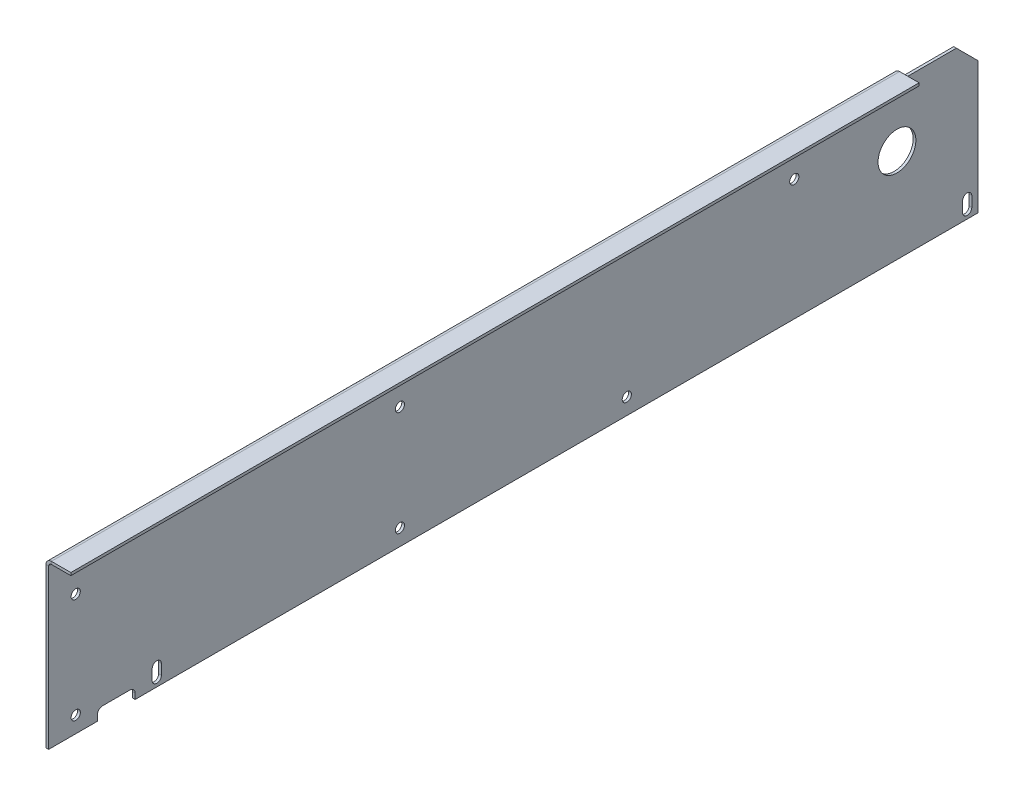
ISO-10303-21;
HEADER;
FILE_DESCRIPTION(('STEP AP214'),'2;1');
FILE_NAME('part.step','',(''),(''),'','','');
FILE_SCHEMA(('AUTOMOTIVE_DESIGN { 1 0 10303 214 1 1 1 1 }'));
ENDSEC;
DATA;
#1=APPLICATION_CONTEXT('core data for automotive mechanical design processes');
#2=APPLICATION_PROTOCOL_DEFINITION('international standard','automotive_design',2000,#1);
#3=PRODUCT_CONTEXT('',#1,'mechanical');
#4=PRODUCT('Part','Part','',(#3));
#5=PRODUCT_RELATED_PRODUCT_CATEGORY('part','',(#4));
#6=PRODUCT_DEFINITION_FORMATION('','',#4);
#7=PRODUCT_DEFINITION_CONTEXT('part definition',#1,'design');
#8=PRODUCT_DEFINITION('design','',#6,#7);
#9=PRODUCT_DEFINITION_SHAPE('','',#8);
#10=(LENGTH_UNIT() NAMED_UNIT(*) SI_UNIT(.MILLI.,.METRE.));
#11=(NAMED_UNIT(*) PLANE_ANGLE_UNIT() SI_UNIT($,.RADIAN.));
#12=(NAMED_UNIT(*) SI_UNIT($,.STERADIAN.) SOLID_ANGLE_UNIT());
#13=UNCERTAINTY_MEASURE_WITH_UNIT(LENGTH_MEASURE(1.E-05),#10,'distance_accuracy_value','');
#14=(GEOMETRIC_REPRESENTATION_CONTEXT(3) GLOBAL_UNCERTAINTY_ASSIGNED_CONTEXT((#13)) GLOBAL_UNIT_ASSIGNED_CONTEXT((#10,
#11,#12)) REPRESENTATION_CONTEXT('',''));
#15=CARTESIAN_POINT('',(0.,0.,0.));
#16=DIRECTION('',(0.,0.,1.));
#17=DIRECTION('',(1.,0.,0.));
#18=AXIS2_PLACEMENT_3D('',#15,#16,#17);
#19=CARTESIAN_POINT('',(2.5,0.,430.));
#20=DIRECTION('',(0.,-1.,0.));
#21=DIRECTION('',(0.,0.,-1.));
#22=AXIS2_PLACEMENT_3D('',#19,#20,#21);
#23=PLANE('',#22);
#24=DIRECTION('',(-1.,0.,0.));
#25=VECTOR('',#24,1.);
#26=CARTESIAN_POINT('',(23.001,0.,350.));
#27=LINE('',#26,#25);
#28=CARTESIAN_POINT('',(2.5,0.,350.));
#29=VERTEX_POINT('',#28);
#30=CARTESIAN_POINT('',(0.,0.,350.));
#31=VERTEX_POINT('',#30);
#32=EDGE_CURVE('E328',#29,#31,#27,.T.);
#33=ORIENTED_EDGE('',*,*,#32,.T.);
#34=DIRECTION('',(0.,0.,-1.));
#35=VECTOR('',#34,1.);
#36=CARTESIAN_POINT('',(0.,0.,430.));
#37=LINE('',#36,#35);
#38=CARTESIAN_POINT('',(0.,0.,-430.));
#39=VERTEX_POINT('',#38);
#40=EDGE_CURVE('E482',#31,#39,#37,.T.);
#41=ORIENTED_EDGE('',*,*,#40,.T.);
#42=DIRECTION('',(-1.,0.,0.));
#43=VECTOR('',#42,1.);
#44=CARTESIAN_POINT('',(2.5,0.,-430.));
#45=LINE('',#44,#43);
#46=CARTESIAN_POINT('',(2.5,0.,-430.));
#47=VERTEX_POINT('',#46);
#48=EDGE_CURVE('E431',#47,#39,#45,.T.);
#49=ORIENTED_EDGE('',*,*,#48,.F.);
#50=DIRECTION('',(0.,0.,-1.));
#51=VECTOR('',#50,1.);
#52=CARTESIAN_POINT('',(2.5,0.,430.));
#53=LINE('',#52,#51);
#54=EDGE_CURVE('E477',#29,#47,#53,.T.);
#55=ORIENTED_EDGE('',*,*,#54,.F.);
#56=EDGE_LOOP('',(#33,#41,#49,#55));
#57=FACE_BOUND('',#56,.T.);
#58=ADVANCED_FACE('F40',(#57),#23,.T.);
#59=CARTESIAN_POINT('',(5.,149.5,-430.));
#60=DIRECTION('',(0.,0.,-1.));
#61=DIRECTION('',(-1.,0.,0.));
#62=AXIS2_PLACEMENT_3D('',#59,#60,#61);
#63=PLANE('',#62);
#64=DIRECTION('',(0.,1.,0.));
#65=VECTOR('',#64,1.);
#66=CARTESIAN_POINT('',(0.,0.,-430.));
#67=LINE('',#66,#65);
#68=CARTESIAN_POINT('',(0.,122.,-430.));
#69=VERTEX_POINT('',#68);
#70=EDGE_CURVE('E428',#39,#69,#67,.T.);
#71=ORIENTED_EDGE('',*,*,#70,.T.);
#72=DIRECTION('',(1.,0.,0.));
#73=VECTOR('',#72,1.);
#74=CARTESIAN_POINT('',(5.,122.,-430.));
#75=LINE('',#74,#73);
#76=CARTESIAN_POINT('',(2.5,122.,-430.));
#77=VERTEX_POINT('',#76);
#78=EDGE_CURVE('E49',#69,#77,#75,.T.);
#79=ORIENTED_EDGE('',*,*,#78,.T.);
#80=DIRECTION('',(0.,1.,0.));
#81=VECTOR('',#80,1.);
#82=CARTESIAN_POINT('',(2.5,0.,-430.));
#83=LINE('',#82,#81);
#84=EDGE_CURVE('E435',#47,#77,#83,.T.);
#85=ORIENTED_EDGE('',*,*,#84,.F.);
#86=ORIENTED_EDGE('',*,*,#48,.T.);
#87=EDGE_LOOP('',(#71,#79,#85,#86));
#88=FACE_BOUND('',#87,.T.);
#89=ADVANCED_FACE('F569',(#88),#63,.T.);
#90=CARTESIAN_POINT('',(0.,149.5,430.));
#91=DIRECTION('',(0.,1.,0.));
#92=DIRECTION('',(-1.,0.,0.));
#93=AXIS2_PLACEMENT_3D('',#90,#91,#92);
#94=PLANE('',#93);
#95=DIRECTION('',(1.,0.,0.));
#96=VECTOR('',#95,1.);
#97=CARTESIAN_POINT('',(0.,149.5,-355.));
#98=LINE('',#97,#96);
#99=CARTESIAN_POINT('',(5.,149.5,-355.));
#100=VERTEX_POINT('',#99);
#101=CARTESIAN_POINT('',(23.,149.5,-355.));
#102=VERTEX_POINT('',#101);
#103=EDGE_CURVE('E392',#100,#102,#98,.T.);
#104=ORIENTED_EDGE('',*,*,#103,.T.);
#105=DIRECTION('',(0.,0.,-1.));
#106=VECTOR('',#105,1.);
#107=CARTESIAN_POINT('',(23.,149.5,430.));
#108=LINE('',#107,#106);
#109=CARTESIAN_POINT('',(23.,149.5,430.));
#110=VERTEX_POINT('',#109);
#111=EDGE_CURVE('E499',#110,#102,#108,.T.);
#112=ORIENTED_EDGE('',*,*,#111,.F.);
#113=DIRECTION('',(1.,0.,0.));
#114=VECTOR('',#113,1.);
#115=CARTESIAN_POINT('',(0.,149.5,430.));
#116=LINE('',#115,#114);
#117=CARTESIAN_POINT('',(5.,149.5,430.));
#118=VERTEX_POINT('',#117);
#119=EDGE_CURVE('E438',#118,#110,#116,.T.);
#120=ORIENTED_EDGE('',*,*,#119,.F.);
#121=DIRECTION('',(0.,0.,-1.));
#122=VECTOR('',#121,1.);
#123=CARTESIAN_POINT('',(5.,149.5,430.));
#124=LINE('',#123,#122);
#125=EDGE_CURVE('E469',#118,#100,#124,.T.);
#126=ORIENTED_EDGE('',*,*,#125,.T.);
#127=EDGE_LOOP('',(#104,#112,#120,#126));
#128=FACE_BOUND('',#127,.T.);
#129=ADVANCED_FACE('F576',(#128),#94,.F.);
#130=CARTESIAN_POINT('',(23.,152.,430.));
#131=DIRECTION('',(1.,0.,0.));
#132=DIRECTION('',(0.,1.,0.));
#133=AXIS2_PLACEMENT_3D('',#130,#131,#132);
#134=PLANE('',#133);
#135=ORIENTED_EDGE('',*,*,#111,.T.);
#136=DIRECTION('',(0.,-1.,0.));
#137=VECTOR('',#136,1.);
#138=CARTESIAN_POINT('',(23.,149.5,-355.));
#139=LINE('',#138,#137);
#140=CARTESIAN_POINT('',(23.,152.,-355.));
#141=VERTEX_POINT('',#140);
#142=EDGE_CURVE('E400',#102,#141,#139,.F.);
#143=ORIENTED_EDGE('',*,*,#142,.T.);
#144=DIRECTION('',(0.,0.,-1.));
#145=VECTOR('',#144,1.);
#146=CARTESIAN_POINT('',(23.,152.,430.));
#147=LINE('',#146,#145);
#148=CARTESIAN_POINT('',(23.,152.,430.));
#149=VERTEX_POINT('',#148);
#150=EDGE_CURVE('E495',#149,#141,#147,.T.);
#151=ORIENTED_EDGE('',*,*,#150,.F.);
#152=DIRECTION('',(0.,-1.,0.));
#153=VECTOR('',#152,1.);
#154=CARTESIAN_POINT('',(23.,152.,430.));
#155=LINE('',#154,#153);
#156=EDGE_CURVE('E441',#149,#110,#155,.T.);
#157=ORIENTED_EDGE('',*,*,#156,.T.);
#158=EDGE_LOOP('',(#135,#143,#151,#157));
#159=FACE_BOUND('',#158,.T.);
#160=ADVANCED_FACE('F652',(#159),#134,.T.);
#161=CARTESIAN_POINT('',(0.,152.,430.));
#162=DIRECTION('',(0.,1.,0.));
#163=DIRECTION('',(-1.,0.,0.));
#164=AXIS2_PLACEMENT_3D('',#161,#162,#163);
#165=PLANE('',#164);
#166=ORIENTED_EDGE('',*,*,#150,.T.);
#167=DIRECTION('',(-1.,0.,0.));
#168=VECTOR('',#167,1.);
#169=CARTESIAN_POINT('',(0.,152.,-355.));
#170=LINE('',#169,#168);
#171=CARTESIAN_POINT('',(5.,152.,-355.));
#172=VERTEX_POINT('',#171);
#173=EDGE_CURVE('E396',#172,#141,#170,.F.);
#174=ORIENTED_EDGE('',*,*,#173,.F.);
#175=DIRECTION('',(0.,0.,-1.));
#176=VECTOR('',#175,1.);
#177=CARTESIAN_POINT('',(5.00000000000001,152.,430.));
#178=LINE('',#177,#176);
#179=CARTESIAN_POINT('',(5.00000000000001,152.,430.));
#180=VERTEX_POINT('',#179);
#181=EDGE_CURVE('E491',#180,#172,#178,.T.);
#182=ORIENTED_EDGE('',*,*,#181,.F.);
#183=DIRECTION('',(1.,0.,0.));
#184=VECTOR('',#183,1.);
#185=CARTESIAN_POINT('',(0.,152.,430.));
#186=LINE('',#185,#184);
#187=EDGE_CURVE('E445',#180,#149,#186,.T.);
#188=ORIENTED_EDGE('',*,*,#187,.T.);
#189=EDGE_LOOP('',(#166,#174,#182,#188));
#190=FACE_BOUND('',#189,.T.);
#191=ADVANCED_FACE('F647',(#190),#165,.T.);
#192=CARTESIAN_POINT('',(5.,147.,430.));
#193=DIRECTION('',(0.,0.,-1.));
#194=DIRECTION('',(-1.,0.,0.));
#195=AXIS2_PLACEMENT_3D('',#192,#193,#194);
#196=CYLINDRICAL_SURFACE('',#195,5.);
#197=ORIENTED_EDGE('',*,*,#181,.T.);
#198=CARTESIAN_POINT('',(5.,147.,-355.));
#199=DIRECTION('',(0.,0.,1.));
#200=DIRECTION('',(1.,0.,0.));
#201=AXIS2_PLACEMENT_3D('',#198,#199,#200);
#202=CIRCLE('',#201,5.);
#203=CARTESIAN_POINT('',(0.,147.,-355.));
#204=VERTEX_POINT('',#203);
#205=EDGE_CURVE('E385',#204,#172,#202,.F.);
#206=ORIENTED_EDGE('',*,*,#205,.F.);
#207=DIRECTION('',(0.,0.,-1.));
#208=VECTOR('',#207,1.);
#209=CARTESIAN_POINT('',(0.,147.,430.));
#210=LINE('',#209,#208);
#211=CARTESIAN_POINT('',(0.,147.,430.));
#212=VERTEX_POINT('',#211);
#213=EDGE_CURVE('E487',#212,#204,#210,.T.);
#214=ORIENTED_EDGE('',*,*,#213,.F.);
#215=CARTESIAN_POINT('',(5.,147.,430.));
#216=DIRECTION('',(0.,0.,1.));
#217=DIRECTION('',(1.,0.,0.));
#218=AXIS2_PLACEMENT_3D('',#215,#216,#217);
#219=CIRCLE('',#218,5.);
#220=EDGE_CURVE('E449',#212,#180,#219,.F.);
#221=ORIENTED_EDGE('',*,*,#220,.T.);
#222=EDGE_LOOP('',(#197,#206,#214,#221));
#223=FACE_BOUND('',#222,.T.);
#224=ADVANCED_FACE('F641',(#223),#196,.T.);
#225=CARTESIAN_POINT('',(0.,0.,430.));
#226=DIRECTION('',(-1.,0.,0.));
#227=DIRECTION('',(0.,0.,1.));
#228=AXIS2_PLACEMENT_3D('',#225,#226,#227);
#229=PLANE('',#228);
#230=CARTESIAN_POINT('',(0.,16.75,330.));
#231=DIRECTION('',(-1.,0.,0.));
#232=DIRECTION('',(0.,0.,-1.));
#233=AXIS2_PLACEMENT_3D('',#230,#231,#232);
#234=CIRCLE('',#233,4.24999999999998);
#235=CARTESIAN_POINT('',(0.,16.75,334.25));
#236=VERTEX_POINT('',#235);
#237=CARTESIAN_POINT('',(0.,16.75,325.75));
#238=VERTEX_POINT('',#237);
#239=EDGE_CURVE('E229',#236,#238,#234,.T.);
#240=ORIENTED_EDGE('',*,*,#239,.F.);
#241=DIRECTION('',(0.,1.,0.));
#242=VECTOR('',#241,1.);
#243=CARTESIAN_POINT('',(0.,16.75,334.25));
#244=LINE('',#243,#242);
#245=CARTESIAN_POINT('',(0.,7.25000000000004,334.25));
#246=VERTEX_POINT('',#245);
#247=EDGE_CURVE('E245',#246,#236,#244,.T.);
#248=ORIENTED_EDGE('',*,*,#247,.F.);
#249=CARTESIAN_POINT('',(0.,7.25000000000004,330.));
#250=DIRECTION('',(-1.,0.,0.));
#251=DIRECTION('',(0.,0.,1.));
#252=AXIS2_PLACEMENT_3D('',#249,#250,#251);
#253=CIRCLE('',#252,4.24999999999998);
#254=CARTESIAN_POINT('',(0.,7.25000000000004,325.75));
#255=VERTEX_POINT('',#254);
#256=EDGE_CURVE('E542',#255,#246,#253,.T.);
#257=ORIENTED_EDGE('',*,*,#256,.F.);
#258=DIRECTION('',(0.,-1.,0.));
#259=VECTOR('',#258,1.);
#260=CARTESIAN_POINT('',(0.,16.75,325.75));
#261=LINE('',#260,#259);
#262=EDGE_CURVE('E220',#238,#255,#261,.T.);
#263=ORIENTED_EDGE('',*,*,#262,.F.);
#264=EDGE_LOOP('',(#240,#248,#257,#263));
#265=FACE_BOUND('',#264,.T.);
#266=CARTESIAN_POINT('',(0.,16.75,-420.));
#267=DIRECTION('',(-1.,0.,0.));
#268=DIRECTION('',(0.,0.,-1.));
#269=AXIS2_PLACEMENT_3D('',#266,#267,#268);
#270=CIRCLE('',#269,4.24999999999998);
#271=CARTESIAN_POINT('',(0.,16.75,-415.75));
#272=VERTEX_POINT('',#271);
#273=CARTESIAN_POINT('',(0.,16.75,-424.25));
#274=VERTEX_POINT('',#273);
#275=EDGE_CURVE('E259',#272,#274,#270,.T.);
#276=ORIENTED_EDGE('',*,*,#275,.F.);
#277=DIRECTION('',(0.,1.,0.));
#278=VECTOR('',#277,1.);
#279=CARTESIAN_POINT('',(0.,16.75,-415.75));
#280=LINE('',#279,#278);
#281=CARTESIAN_POINT('',(0.,7.25000000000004,-415.75));
#282=VERTEX_POINT('',#281);
#283=EDGE_CURVE('E270',#282,#272,#280,.T.);
#284=ORIENTED_EDGE('',*,*,#283,.F.);
#285=CARTESIAN_POINT('',(0.,7.25000000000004,-420.));
#286=DIRECTION('',(-1.,0.,0.));
#287=DIRECTION('',(0.,0.,1.));
#288=AXIS2_PLACEMENT_3D('',#285,#286,#287);
#289=CIRCLE('',#288,4.24999999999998);
#290=CARTESIAN_POINT('',(0.,7.25000000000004,-424.25));
#291=VERTEX_POINT('',#290);
#292=EDGE_CURVE('E266',#291,#282,#289,.T.);
#293=ORIENTED_EDGE('',*,*,#292,.F.);
#294=DIRECTION('',(0.,-1.,0.));
#295=VECTOR('',#294,1.);
#296=CARTESIAN_POINT('',(0.,16.75,-424.25));
#297=LINE('',#296,#295);
#298=EDGE_CURVE('E262',#274,#291,#297,.T.);
#299=ORIENTED_EDGE('',*,*,#298,.F.);
#300=EDGE_LOOP('',(#276,#284,#293,#299));
#301=FACE_BOUND('',#300,.T.);
#302=DIRECTION('',(0.,0.,1.));
#303=VECTOR('',#302,1.);
#304=CARTESIAN_POINT('',(0.,142.,430.));
#305=LINE('',#304,#303);
#306=CARTESIAN_POINT('',(0.,142.,-410.));
#307=VERTEX_POINT('',#306);
#308=CARTESIAN_POINT('',(0.,142.,-355.));
#309=VERTEX_POINT('',#308);
#310=EDGE_CURVE('E414',#307,#309,#305,.T.);
#311=ORIENTED_EDGE('',*,*,#310,.F.);
#312=DIRECTION('',(0.,-0.707106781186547,-0.707106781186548));
#313=VECTOR('',#312,1.);
#314=CARTESIAN_POINT('',(0.,491.,-60.9999999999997));
#315=LINE('',#314,#313);
#316=EDGE_CURVE('E63',#307,#69,#315,.T.);
#317=ORIENTED_EDGE('',*,*,#316,.T.);
#318=ORIENTED_EDGE('',*,*,#70,.F.);
#319=ORIENTED_EDGE('',*,*,#40,.F.);
#320=DIRECTION('',(0.,-1.,0.));
#321=VECTOR('',#320,1.);
#322=CARTESIAN_POINT('',(0.,0.,350.));
#323=LINE('',#322,#321);
#324=CARTESIAN_POINT('',(0.,5.,350.));
#325=VERTEX_POINT('',#324);
#326=EDGE_CURVE('E310',#325,#31,#323,.T.);
#327=ORIENTED_EDGE('',*,*,#326,.F.);
#328=CARTESIAN_POINT('',(0.,5.,355.));
#329=DIRECTION('',(-1.,0.,0.));
#330=DIRECTION('',(0.,0.,1.));
#331=AXIS2_PLACEMENT_3D('',#328,#329,#330);
#332=CIRCLE('',#331,5.);
#333=CARTESIAN_POINT('',(0.,10.,355.));
#334=VERTEX_POINT('',#333);
#335=EDGE_CURVE('E324',#334,#325,#332,.T.);
#336=ORIENTED_EDGE('',*,*,#335,.F.);
#337=DIRECTION('',(0.,0.,-1.));
#338=VECTOR('',#337,1.);
#339=CARTESIAN_POINT('',(0.,10.,355.));
#340=LINE('',#339,#338);
#341=CARTESIAN_POINT('',(0.,10.,380.));
#342=VERTEX_POINT('',#341);
#343=EDGE_CURVE('E320',#342,#334,#340,.T.);
#344=ORIENTED_EDGE('',*,*,#343,.F.);
#345=CARTESIAN_POINT('',(0.,5.,380.));
#346=DIRECTION('',(-1.,0.,0.));
#347=DIRECTION('',(0.,0.,1.));
#348=AXIS2_PLACEMENT_3D('',#345,#346,#347);
#349=CIRCLE('',#348,5.);
#350=CARTESIAN_POINT('',(0.,5.,385.));
#351=VERTEX_POINT('',#350);
#352=EDGE_CURVE('E316',#351,#342,#349,.T.);
#353=ORIENTED_EDGE('',*,*,#352,.F.);
#354=DIRECTION('',(0.,1.,0.));
#355=VECTOR('',#354,1.);
#356=CARTESIAN_POINT('',(0.,0.,385.));
#357=LINE('',#356,#355);
#358=CARTESIAN_POINT('',(0.,0.,385.));
#359=VERTEX_POINT('',#358);
#360=EDGE_CURVE('E313',#359,#351,#357,.T.);
#361=ORIENTED_EDGE('',*,*,#360,.F.);
#362=CARTESIAN_POINT('',(0.,0.,430.));
#363=VERTEX_POINT('',#362);
#364=EDGE_CURVE('E483',#363,#359,#37,.T.);
#365=ORIENTED_EDGE('',*,*,#364,.F.);
#366=DIRECTION('',(0.,1.,0.));
#367=VECTOR('',#366,1.);
#368=CARTESIAN_POINT('',(0.,0.,430.));
#369=LINE('',#368,#367);
#370=EDGE_CURVE('E453',#363,#212,#369,.T.);
#371=ORIENTED_EDGE('',*,*,#370,.T.);
#372=ORIENTED_EDGE('',*,*,#213,.T.);
#373=DIRECTION('',(0.,1.,0.));
#374=VECTOR('',#373,1.);
#375=CARTESIAN_POINT('',(0.,0.,-355.));
#376=LINE('',#375,#374);
#377=EDGE_CURVE('E417',#309,#204,#376,.T.);
#378=ORIENTED_EDGE('',*,*,#377,.F.);
#379=EDGE_LOOP('',(#311,#317,#318,#319,#327,#336,#344,#353,#361,#365,#371,#372,#378));
#380=FACE_BOUND('',#379,.T.);
#381=CARTESIAN_POINT('',(0.,14.9999999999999,405.));
#382=DIRECTION('',(-1.,0.,0.));
#383=DIRECTION('',(0.,0.,1.));
#384=AXIS2_PLACEMENT_3D('',#381,#382,#383);
#385=CIRCLE('',#384,4.24999999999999);
#386=CARTESIAN_POINT('',(0.,14.9999999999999,409.25));
#387=VERTEX_POINT('',#386);
#388=EDGE_CURVE('E332',#387,#387,#385,.T.);
#389=ORIENTED_EDGE('',*,*,#388,.F.);
#390=EDGE_LOOP('',(#389));
#391=FACE_BOUND('',#390,.T.);
#392=CARTESIAN_POINT('',(0.,112.,405.));
#393=DIRECTION('',(-1.,0.,0.));
#394=DIRECTION('',(0.,0.,1.));
#395=AXIS2_PLACEMENT_3D('',#392,#393,#394);
#396=CIRCLE('',#395,4.24999999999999);
#397=CARTESIAN_POINT('',(0.,112.,409.25));
#398=VERTEX_POINT('',#397);
#399=EDGE_CURVE('E352',#398,#398,#396,.T.);
#400=ORIENTED_EDGE('',*,*,#399,.F.);
#401=EDGE_LOOP('',(#400));
#402=FACE_BOUND('',#401,.T.);
#403=CARTESIAN_POINT('',(0.,112.,105.));
#404=DIRECTION('',(-1.,0.,0.));
#405=DIRECTION('',(0.,0.,1.));
#406=AXIS2_PLACEMENT_3D('',#403,#404,#405);
#407=CIRCLE('',#406,4.24999999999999);
#408=CARTESIAN_POINT('',(0.,112.,109.25));
#409=VERTEX_POINT('',#408);
#410=EDGE_CURVE('E357',#409,#409,#407,.T.);
#411=ORIENTED_EDGE('',*,*,#410,.F.);
#412=EDGE_LOOP('',(#411));
#413=FACE_BOUND('',#412,.T.);
#414=CARTESIAN_POINT('',(0.,14.9999999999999,105.));
#415=DIRECTION('',(-1.,0.,0.));
#416=DIRECTION('',(0.,0.,1.));
#417=AXIS2_PLACEMENT_3D('',#414,#415,#416);
#418=CIRCLE('',#417,4.24999999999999);
#419=CARTESIAN_POINT('',(0.,14.9999999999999,109.25));
#420=VERTEX_POINT('',#419);
#421=EDGE_CURVE('E362',#420,#420,#418,.T.);
#422=ORIENTED_EDGE('',*,*,#421,.F.);
#423=EDGE_LOOP('',(#422));
#424=FACE_BOUND('',#423,.T.);
#425=CARTESIAN_POINT('',(0.,14.9999999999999,-105.));
#426=DIRECTION('',(-1.,0.,0.));
#427=DIRECTION('',(0.,0.,1.));
#428=AXIS2_PLACEMENT_3D('',#425,#426,#427);
#429=CIRCLE('',#428,4.24999999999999);
#430=CARTESIAN_POINT('',(0.,14.9999999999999,-100.75));
#431=VERTEX_POINT('',#430);
#432=EDGE_CURVE('E367',#431,#431,#429,.T.);
#433=ORIENTED_EDGE('',*,*,#432,.F.);
#434=EDGE_LOOP('',(#433));
#435=FACE_BOUND('',#434,.T.);
#436=CARTESIAN_POINT('',(0.,112.,-260.));
#437=DIRECTION('',(-1.,0.,0.));
#438=DIRECTION('',(0.,0.,1.));
#439=AXIS2_PLACEMENT_3D('',#436,#437,#438);
#440=CIRCLE('',#439,4.24999999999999);
#441=CARTESIAN_POINT('',(0.,112.,-255.75));
#442=VERTEX_POINT('',#441);
#443=EDGE_CURVE('E372',#442,#442,#440,.T.);
#444=ORIENTED_EDGE('',*,*,#443,.F.);
#445=EDGE_LOOP('',(#444));
#446=FACE_BOUND('',#445,.T.);
#447=CARTESIAN_POINT('',(0.,87.,-355.));
#448=DIRECTION('',(-1.,0.,0.));
#449=DIRECTION('',(0.,0.,1.));
#450=AXIS2_PLACEMENT_3D('',#447,#448,#449);
#451=CIRCLE('',#450,17.4999999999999);
#452=CARTESIAN_POINT('',(0.,87.,-337.5));
#453=VERTEX_POINT('',#452);
#454=EDGE_CURVE('E377',#453,#453,#451,.T.);
#455=ORIENTED_EDGE('',*,*,#454,.F.);
#456=EDGE_LOOP('',(#455));
#457=FACE_BOUND('',#456,.T.);
#458=ADVANCED_FACE('F554',(#265,#301,#380,#391,#402,#413,#424,#435,#446,#457),#229,.T.);
#459=CARTESIAN_POINT('',(2.5,0.,430.));
#460=DIRECTION('',(-1.,0.,0.));
#461=DIRECTION('',(0.,0.,1.));
#462=AXIS2_PLACEMENT_3D('',#459,#460,#461);
#463=PLANE('',#462);
#464=DIRECTION('',(0.,-1.,0.));
#465=VECTOR('',#464,1.);
#466=CARTESIAN_POINT('',(2.5,16.75,334.25));
#467=LINE('',#466,#465);
#468=CARTESIAN_POINT('',(2.50000000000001,16.75,334.25));
#469=VERTEX_POINT('',#468);
#470=CARTESIAN_POINT('',(2.50000000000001,7.25000000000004,334.25));
#471=VERTEX_POINT('',#470);
#472=EDGE_CURVE('E235',#469,#471,#467,.T.);
#473=ORIENTED_EDGE('',*,*,#472,.F.);
#474=CARTESIAN_POINT('',(2.5,16.75,330.));
#475=DIRECTION('',(-1.,0.,0.));
#476=DIRECTION('',(0.,0.,1.));
#477=AXIS2_PLACEMENT_3D('',#474,#475,#476);
#478=CIRCLE('',#477,4.24999999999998);
#479=CARTESIAN_POINT('',(2.5,16.75,325.75));
#480=VERTEX_POINT('',#479);
#481=EDGE_CURVE('E226',#480,#469,#478,.F.);
#482=ORIENTED_EDGE('',*,*,#481,.F.);
#483=DIRECTION('',(0.,1.,0.));
#484=VECTOR('',#483,1.);
#485=CARTESIAN_POINT('',(2.5,16.75,325.75));
#486=LINE('',#485,#484);
#487=CARTESIAN_POINT('',(2.5,7.25000000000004,325.75));
#488=VERTEX_POINT('',#487);
#489=EDGE_CURVE('E209',#488,#480,#486,.T.);
#490=ORIENTED_EDGE('',*,*,#489,.F.);
#491=CARTESIAN_POINT('',(2.5,7.25000000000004,330.));
#492=DIRECTION('',(-1.,0.,0.));
#493=DIRECTION('',(0.,0.,1.));
#494=AXIS2_PLACEMENT_3D('',#491,#492,#493);
#495=CIRCLE('',#494,4.24999999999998);
#496=EDGE_CURVE('E534',#471,#488,#495,.F.);
#497=ORIENTED_EDGE('',*,*,#496,.F.);
#498=EDGE_LOOP('',(#473,#482,#490,#497));
#499=FACE_BOUND('',#498,.T.);
#500=DIRECTION('',(0.,-1.,0.));
#501=VECTOR('',#500,1.);
#502=CARTESIAN_POINT('',(2.5,16.75,-415.75));
#503=LINE('',#502,#501);
#504=CARTESIAN_POINT('',(2.50000000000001,16.75,-415.75));
#505=VERTEX_POINT('',#504);
#506=CARTESIAN_POINT('',(2.50000000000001,7.25000000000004,-415.75));
#507=VERTEX_POINT('',#506);
#508=EDGE_CURVE('E251',#505,#507,#503,.T.);
#509=ORIENTED_EDGE('',*,*,#508,.F.);
#510=CARTESIAN_POINT('',(2.5,16.75,-420.));
#511=DIRECTION('',(-1.,0.,0.));
#512=DIRECTION('',(0.,0.,1.));
#513=AXIS2_PLACEMENT_3D('',#510,#511,#512);
#514=CIRCLE('',#513,4.24999999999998);
#515=CARTESIAN_POINT('',(2.5,16.75,-424.25));
#516=VERTEX_POINT('',#515);
#517=EDGE_CURVE('E255',#516,#505,#514,.F.);
#518=ORIENTED_EDGE('',*,*,#517,.F.);
#519=DIRECTION('',(0.,1.,0.));
#520=VECTOR('',#519,1.);
#521=CARTESIAN_POINT('',(2.5,16.75,-424.25));
#522=LINE('',#521,#520);
#523=CARTESIAN_POINT('',(2.5,7.25000000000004,-424.25));
#524=VERTEX_POINT('',#523);
#525=EDGE_CURVE('E278',#524,#516,#522,.T.);
#526=ORIENTED_EDGE('',*,*,#525,.F.);
#527=CARTESIAN_POINT('',(2.5,7.25000000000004,-420.));
#528=DIRECTION('',(-1.,0.,0.));
#529=DIRECTION('',(0.,0.,1.));
#530=AXIS2_PLACEMENT_3D('',#527,#528,#529);
#531=CIRCLE('',#530,4.24999999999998);
#532=EDGE_CURVE('E242',#507,#524,#531,.F.);
#533=ORIENTED_EDGE('',*,*,#532,.F.);
#534=EDGE_LOOP('',(#509,#518,#526,#533));
#535=FACE_BOUND('',#534,.T.);
#536=CARTESIAN_POINT('',(2.5,14.9999999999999,405.));
#537=DIRECTION('',(-1.,0.,0.));
#538=DIRECTION('',(0.,0.,1.));
#539=AXIS2_PLACEMENT_3D('',#536,#537,#538);
#540=CIRCLE('',#539,4.24999999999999);
#541=CARTESIAN_POINT('',(2.5,14.9999999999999,409.25));
#542=VERTEX_POINT('',#541);
#543=EDGE_CURVE('E351',#542,#542,#540,.T.);
#544=ORIENTED_EDGE('',*,*,#543,.T.);
#545=EDGE_LOOP('',(#544));
#546=FACE_BOUND('',#545,.T.);
#547=CARTESIAN_POINT('',(2.5,112.,405.));
#548=DIRECTION('',(-1.,0.,0.));
#549=DIRECTION('',(0.,0.,1.));
#550=AXIS2_PLACEMENT_3D('',#547,#548,#549);
#551=CIRCLE('',#550,4.24999999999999);
#552=CARTESIAN_POINT('',(2.5,112.,409.25));
#553=VERTEX_POINT('',#552);
#554=EDGE_CURVE('E356',#553,#553,#551,.T.);
#555=ORIENTED_EDGE('',*,*,#554,.T.);
#556=EDGE_LOOP('',(#555));
#557=FACE_BOUND('',#556,.T.);
#558=CARTESIAN_POINT('',(2.5,112.,105.));
#559=DIRECTION('',(-1.,0.,0.));
#560=DIRECTION('',(0.,0.,1.));
#561=AXIS2_PLACEMENT_3D('',#558,#559,#560);
#562=CIRCLE('',#561,4.24999999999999);
#563=CARTESIAN_POINT('',(2.5,112.,109.25));
#564=VERTEX_POINT('',#563);
#565=EDGE_CURVE('E361',#564,#564,#562,.T.);
#566=ORIENTED_EDGE('',*,*,#565,.T.);
#567=EDGE_LOOP('',(#566));
#568=FACE_BOUND('',#567,.T.);
#569=CARTESIAN_POINT('',(2.5,14.9999999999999,105.));
#570=DIRECTION('',(-1.,0.,0.));
#571=DIRECTION('',(0.,0.,1.));
#572=AXIS2_PLACEMENT_3D('',#569,#570,#571);
#573=CIRCLE('',#572,4.24999999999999);
#574=CARTESIAN_POINT('',(2.5,14.9999999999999,109.25));
#575=VERTEX_POINT('',#574);
#576=EDGE_CURVE('E366',#575,#575,#573,.T.);
#577=ORIENTED_EDGE('',*,*,#576,.T.);
#578=EDGE_LOOP('',(#577));
#579=FACE_BOUND('',#578,.T.);
#580=CARTESIAN_POINT('',(2.5,14.9999999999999,-105.));
#581=DIRECTION('',(-1.,0.,0.));
#582=DIRECTION('',(0.,0.,1.));
#583=AXIS2_PLACEMENT_3D('',#580,#581,#582);
#584=CIRCLE('',#583,4.24999999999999);
#585=CARTESIAN_POINT('',(2.5,14.9999999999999,-100.75));
#586=VERTEX_POINT('',#585);
#587=EDGE_CURVE('E371',#586,#586,#584,.T.);
#588=ORIENTED_EDGE('',*,*,#587,.T.);
#589=EDGE_LOOP('',(#588));
#590=FACE_BOUND('',#589,.T.);
#591=CARTESIAN_POINT('',(2.5,112.,-260.));
#592=DIRECTION('',(-1.,0.,0.));
#593=DIRECTION('',(0.,0.,1.));
#594=AXIS2_PLACEMENT_3D('',#591,#592,#593);
#595=CIRCLE('',#594,4.24999999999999);
#596=CARTESIAN_POINT('',(2.5,112.,-255.75));
#597=VERTEX_POINT('',#596);
#598=EDGE_CURVE('E376',#597,#597,#595,.T.);
#599=ORIENTED_EDGE('',*,*,#598,.T.);
#600=EDGE_LOOP('',(#599));
#601=FACE_BOUND('',#600,.T.);
#602=CARTESIAN_POINT('',(2.5,87.,-355.));
#603=DIRECTION('',(-1.,0.,0.));
#604=DIRECTION('',(0.,0.,1.));
#605=AXIS2_PLACEMENT_3D('',#602,#603,#604);
#606=CIRCLE('',#605,17.4999999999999);
#607=CARTESIAN_POINT('',(2.5,87.,-337.5));
#608=VERTEX_POINT('',#607);
#609=EDGE_CURVE('E381',#608,#608,#606,.F.);
#610=ORIENTED_EDGE('',*,*,#609,.F.);
#611=EDGE_LOOP('',(#610));
#612=FACE_BOUND('',#611,.T.);
#613=ORIENTED_EDGE('',*,*,#84,.T.);
#614=DIRECTION('',(0.,0.707106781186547,0.707106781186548));
#615=VECTOR('',#614,1.);
#616=CARTESIAN_POINT('',(2.5,142.,-410.));
#617=LINE('',#616,#615);
#618=CARTESIAN_POINT('',(2.5,142.,-410.));
#619=VERTEX_POINT('',#618);
#620=EDGE_CURVE('E11',#77,#619,#617,.T.);
#621=ORIENTED_EDGE('',*,*,#620,.T.);
#622=DIRECTION('',(0.,0.,1.));
#623=VECTOR('',#622,1.);
#624=CARTESIAN_POINT('',(2.5,142.,430.));
#625=LINE('',#624,#623);
#626=CARTESIAN_POINT('',(2.5,142.,-355.));
#627=VERTEX_POINT('',#626);
#628=EDGE_CURVE('E404',#619,#627,#625,.T.);
#629=ORIENTED_EDGE('',*,*,#628,.T.);
#630=DIRECTION('',(0.,1.,0.));
#631=VECTOR('',#630,1.);
#632=CARTESIAN_POINT('',(2.5,0.,-355.));
#633=LINE('',#632,#631);
#634=CARTESIAN_POINT('',(2.5,147.,-355.));
#635=VERTEX_POINT('',#634);
#636=EDGE_CURVE('E410',#627,#635,#633,.T.);
#637=ORIENTED_EDGE('',*,*,#636,.T.);
#638=DIRECTION('',(0.,0.,-1.));
#639=VECTOR('',#638,1.);
#640=CARTESIAN_POINT('',(2.5,147.,430.));
#641=LINE('',#640,#639);
#642=CARTESIAN_POINT('',(2.5,147.,430.));
#643=VERTEX_POINT('',#642);
#644=EDGE_CURVE('E473',#643,#635,#641,.T.);
#645=ORIENTED_EDGE('',*,*,#644,.F.);
#646=DIRECTION('',(0.,1.,0.));
#647=VECTOR('',#646,1.);
#648=CARTESIAN_POINT('',(2.5,0.,430.));
#649=LINE('',#648,#647);
#650=CARTESIAN_POINT('',(2.5,0.,430.));
#651=VERTEX_POINT('',#650);
#652=EDGE_CURVE('E461',#651,#643,#649,.T.);
#653=ORIENTED_EDGE('',*,*,#652,.F.);
#654=CARTESIAN_POINT('',(2.5,0.,385.));
#655=VERTEX_POINT('',#654);
#656=EDGE_CURVE('E478',#651,#655,#53,.T.);
#657=ORIENTED_EDGE('',*,*,#656,.T.);
#658=DIRECTION('',(0.,-1.,0.));
#659=VECTOR('',#658,1.);
#660=CARTESIAN_POINT('',(2.5,0.,385.));
#661=LINE('',#660,#659);
#662=CARTESIAN_POINT('',(2.50000000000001,5.,385.));
#663=VERTEX_POINT('',#662);
#664=EDGE_CURVE('E291',#663,#655,#661,.T.);
#665=ORIENTED_EDGE('',*,*,#664,.F.);
#666=CARTESIAN_POINT('',(2.5,5.,380.));
#667=DIRECTION('',(-1.,0.,0.));
#668=DIRECTION('',(0.,0.,1.));
#669=AXIS2_PLACEMENT_3D('',#666,#667,#668);
#670=CIRCLE('',#669,5.);
#671=CARTESIAN_POINT('',(2.50000000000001,10.,380.));
#672=VERTEX_POINT('',#671);
#673=EDGE_CURVE('E294',#672,#663,#670,.F.);
#674=ORIENTED_EDGE('',*,*,#673,.F.);
#675=DIRECTION('',(0.,0.,1.));
#676=VECTOR('',#675,1.);
#677=CARTESIAN_POINT('',(2.5,10.,355.));
#678=LINE('',#677,#676);
#679=CARTESIAN_POINT('',(2.50000000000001,10.,355.));
#680=VERTEX_POINT('',#679);
#681=EDGE_CURVE('E298',#680,#672,#678,.T.);
#682=ORIENTED_EDGE('',*,*,#681,.F.);
#683=CARTESIAN_POINT('',(2.5,5.,355.));
#684=DIRECTION('',(-1.,0.,0.));
#685=DIRECTION('',(0.,0.,1.));
#686=AXIS2_PLACEMENT_3D('',#683,#684,#685);
#687=CIRCLE('',#686,5.);
#688=CARTESIAN_POINT('',(2.50000000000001,5.,350.));
#689=VERTEX_POINT('',#688);
#690=EDGE_CURVE('E302',#689,#680,#687,.F.);
#691=ORIENTED_EDGE('',*,*,#690,.F.);
#692=DIRECTION('',(0.,1.,0.));
#693=VECTOR('',#692,1.);
#694=CARTESIAN_POINT('',(2.5,0.,350.));
#695=LINE('',#694,#693);
#696=EDGE_CURVE('E306',#29,#689,#695,.T.);
#697=ORIENTED_EDGE('',*,*,#696,.F.);
#698=ORIENTED_EDGE('',*,*,#54,.T.);
#699=EDGE_LOOP('',(#613,#621,#629,#637,#645,#653,#657,#665,#674,#682,#691,#697,#698));
#700=FACE_BOUND('',#699,.T.);
#701=ADVANCED_FACE('F232',(#499,#535,#546,#557,#568,#579,#590,#601,#612,#700),#463,.F.);
#702=CARTESIAN_POINT('',(5.,147.,430.));
#703=DIRECTION('',(0.,0.,-1.));
#704=DIRECTION('',(-1.,0.,0.));
#705=AXIS2_PLACEMENT_3D('',#702,#703,#704);
#706=CYLINDRICAL_SURFACE('',#705,2.5);
#707=CARTESIAN_POINT('',(5.,147.,-355.));
#708=DIRECTION('',(0.,0.,-1.));
#709=DIRECTION('',(-1.,0.,0.));
#710=AXIS2_PLACEMENT_3D('',#707,#708,#709);
#711=CIRCLE('',#710,2.5);
#712=EDGE_CURVE('E388',#635,#100,#711,.T.);
#713=ORIENTED_EDGE('',*,*,#712,.T.);
#714=ORIENTED_EDGE('',*,*,#125,.F.);
#715=CARTESIAN_POINT('',(5.,147.,430.));
#716=DIRECTION('',(0.,0.,1.));
#717=DIRECTION('',(1.,0.,0.));
#718=AXIS2_PLACEMENT_3D('',#715,#716,#717);
#719=CIRCLE('',#718,2.5);
#720=EDGE_CURVE('E465',#643,#118,#719,.F.);
#721=ORIENTED_EDGE('',*,*,#720,.F.);
#722=ORIENTED_EDGE('',*,*,#644,.T.);
#723=EDGE_LOOP('',(#713,#714,#721,#722));
#724=FACE_BOUND('',#723,.T.);
#725=ADVANCED_FACE('F659',(#724),#706,.F.);
#726=CARTESIAN_POINT('',(5.00000000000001,152.,430.));
#727=DIRECTION('',(0.,0.,1.));
#728=DIRECTION('',(1.,0.,0.));
#729=AXIS2_PLACEMENT_3D('',#726,#727,#728);
#730=PLANE('',#729);
#731=DIRECTION('',(0.,-1.,0.));
#732=VECTOR('',#731,1.);
#733=CARTESIAN_POINT('',(5.00000000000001,152.,430.));
#734=LINE('',#733,#732);
#735=EDGE_CURVE('E506',#180,#118,#734,.T.);
#736=ORIENTED_EDGE('',*,*,#735,.F.);
#737=ORIENTED_EDGE('',*,*,#220,.F.);
#738=DIRECTION('',(-1.,0.,0.));
#739=VECTOR('',#738,1.);
#740=CARTESIAN_POINT('',(2.5,147.,430.));
#741=LINE('',#740,#739);
#742=EDGE_CURVE('E503',#643,#212,#741,.T.);
#743=ORIENTED_EDGE('',*,*,#742,.F.);
#744=ORIENTED_EDGE('',*,*,#720,.T.);
#745=EDGE_LOOP('',(#736,#737,#743,#744));
#746=FACE_BOUND('',#745,.T.);
#747=ADVANCED_FACE('F42',(#746),#730,.T.);
#748=CARTESIAN_POINT('',(2.5,147.,430.));
#749=DIRECTION('',(0.,0.,1.));
#750=DIRECTION('',(1.,0.,0.));
#751=AXIS2_PLACEMENT_3D('',#748,#749,#750);
#752=PLANE('',#751);
#753=ORIENTED_EDGE('',*,*,#187,.F.);
#754=ORIENTED_EDGE('',*,*,#735,.T.);
#755=ORIENTED_EDGE('',*,*,#119,.T.);
#756=ORIENTED_EDGE('',*,*,#156,.F.);
#757=EDGE_LOOP('',(#753,#754,#755,#756));
#758=FACE_BOUND('',#757,.T.);
#759=ADVANCED_FACE('F582',(#758),#752,.T.);
#760=DIRECTION('',(-1.,0.,0.));
#761=VECTOR('',#760,1.);
#762=CARTESIAN_POINT('',(23.001,0.,385.));
#763=LINE('',#762,#761);
#764=EDGE_CURVE('E342',#655,#359,#763,.T.);
#765=ORIENTED_EDGE('',*,*,#764,.F.);
#766=ORIENTED_EDGE('',*,*,#656,.F.);
#767=DIRECTION('',(-1.,0.,0.));
#768=VECTOR('',#767,1.);
#769=CARTESIAN_POINT('',(2.5,0.,430.));
#770=LINE('',#769,#768);
#771=EDGE_CURVE('E457',#651,#363,#770,.T.);
#772=ORIENTED_EDGE('',*,*,#771,.T.);
#773=ORIENTED_EDGE('',*,*,#364,.T.);
#774=EDGE_LOOP('',(#765,#766,#772,#773));
#775=FACE_BOUND('',#774,.T.);
#776=ADVANCED_FACE('F572',(#775),#23,.T.);
#777=CARTESIAN_POINT('',(5.,147.,430.));
#778=DIRECTION('',(0.,0.,1.));
#779=DIRECTION('',(1.,0.,0.));
#780=AXIS2_PLACEMENT_3D('',#777,#778,#779);
#781=PLANE('',#780);
#782=ORIENTED_EDGE('',*,*,#652,.T.);
#783=ORIENTED_EDGE('',*,*,#742,.T.);
#784=ORIENTED_EDGE('',*,*,#370,.F.);
#785=ORIENTED_EDGE('',*,*,#771,.F.);
#786=EDGE_LOOP('',(#782,#783,#784,#785));
#787=FACE_BOUND('',#786,.T.);
#788=ADVANCED_FACE('F581',(#787),#781,.T.);
#789=CARTESIAN_POINT('',(2.5,0.,-355.));
#790=DIRECTION('',(0.,0.,1.));
#791=DIRECTION('',(0.,1.,0.));
#792=AXIS2_PLACEMENT_3D('',#789,#790,#791);
#793=PLANE('',#792);
#794=DIRECTION('',(1.,0.,0.));
#795=VECTOR('',#794,1.);
#796=CARTESIAN_POINT('',(2.5,147.,-355.));
#797=LINE('',#796,#795);
#798=EDGE_CURVE('E424',#635,#204,#797,.F.);
#799=ORIENTED_EDGE('',*,*,#798,.F.);
#800=ORIENTED_EDGE('',*,*,#636,.F.);
#801=DIRECTION('',(1.,0.,0.));
#802=VECTOR('',#801,1.);
#803=CARTESIAN_POINT('',(2.5,142.,-355.));
#804=LINE('',#803,#802);
#805=EDGE_CURVE('E420',#627,#309,#804,.F.);
#806=ORIENTED_EDGE('',*,*,#805,.T.);
#807=ORIENTED_EDGE('',*,*,#377,.T.);
#808=EDGE_LOOP('',(#799,#800,#806,#807));
#809=FACE_BOUND('',#808,.T.);
#810=ADVANCED_FACE('F588',(#809),#793,.F.);
#811=CARTESIAN_POINT('',(2.5,142.,430.));
#812=DIRECTION('',(0.,-1.,0.));
#813=DIRECTION('',(0.,0.,1.));
#814=AXIS2_PLACEMENT_3D('',#811,#812,#813);
#815=PLANE('',#814);
#816=ORIENTED_EDGE('',*,*,#628,.F.);
#817=DIRECTION('',(1.,0.,0.));
#818=VECTOR('',#817,1.);
#819=CARTESIAN_POINT('',(2.5,142.,-410.));
#820=LINE('',#819,#818);
#821=EDGE_CURVE('E509',#619,#307,#820,.F.);
#822=ORIENTED_EDGE('',*,*,#821,.T.);
#823=ORIENTED_EDGE('',*,*,#310,.T.);
#824=ORIENTED_EDGE('',*,*,#805,.F.);
#825=EDGE_LOOP('',(#816,#822,#823,#824));
#826=FACE_BOUND('',#825,.T.);
#827=ADVANCED_FACE('F632',(#826),#815,.F.);
#828=CARTESIAN_POINT('',(0.,149.5,-355.));
#829=DIRECTION('',(0.,0.,1.));
#830=DIRECTION('',(1.,0.,0.));
#831=AXIS2_PLACEMENT_3D('',#828,#829,#830);
#832=PLANE('',#831);
#833=ORIENTED_EDGE('',*,*,#142,.F.);
#834=ORIENTED_EDGE('',*,*,#103,.F.);
#835=DIRECTION('',(0.,-1.,0.));
#836=VECTOR('',#835,1.);
#837=CARTESIAN_POINT('',(5.,149.5,-355.));
#838=LINE('',#837,#836);
#839=EDGE_CURVE('E399',#100,#172,#838,.F.);
#840=ORIENTED_EDGE('',*,*,#839,.T.);
#841=ORIENTED_EDGE('',*,*,#173,.T.);
#842=EDGE_LOOP('',(#833,#834,#840,#841));
#843=FACE_BOUND('',#842,.T.);
#844=ADVANCED_FACE('F655',(#843),#832,.F.);
#845=CARTESIAN_POINT('',(5.,147.,-355.));
#846=DIRECTION('',(0.,0.,-1.));
#847=DIRECTION('',(-1.,0.,0.));
#848=AXIS2_PLACEMENT_3D('',#845,#846,#847);
#849=PLANE('',#848);
#850=ORIENTED_EDGE('',*,*,#205,.T.);
#851=ORIENTED_EDGE('',*,*,#839,.F.);
#852=ORIENTED_EDGE('',*,*,#712,.F.);
#853=ORIENTED_EDGE('',*,*,#798,.T.);
#854=EDGE_LOOP('',(#850,#851,#852,#853));
#855=FACE_BOUND('',#854,.T.);
#856=ADVANCED_FACE('F639',(#855),#849,.T.);
#857=CARTESIAN_POINT('',(23.001,87.,-355.));
#858=DIRECTION('',(-1.,0.,0.));
#859=DIRECTION('',(0.,0.,1.));
#860=AXIS2_PLACEMENT_3D('',#857,#858,#859);
#861=CYLINDRICAL_SURFACE('',#860,17.4999999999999);
#862=CARTESIAN_POINT('',(0.,87.,-337.5));
#863=CARTESIAN_POINT('',(0.0260416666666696,87.,-337.5));
#864=CARTESIAN_POINT('',(0.0520833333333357,87.,-337.5));
#865=CARTESIAN_POINT('',(0.104166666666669,87.,-337.5));
#866=CARTESIAN_POINT('',(0.130208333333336,87.,-337.5));
#867=CARTESIAN_POINT('',(0.18229166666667,87.,-337.5));
#868=CARTESIAN_POINT('',(0.208333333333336,87.,-337.5));
#869=CARTESIAN_POINT('',(0.260416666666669,87.,-337.5));
#870=CARTESIAN_POINT('',(0.286458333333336,87.,-337.5));
#871=CARTESIAN_POINT('',(0.33854166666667,87.,-337.5));
#872=CARTESIAN_POINT('',(0.364583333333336,87.,-337.5));
#873=CARTESIAN_POINT('',(0.416666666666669,87.,-337.5));
#874=CARTESIAN_POINT('',(0.442708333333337,87.,-337.5));
#875=CARTESIAN_POINT('',(0.49479166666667,87.,-337.5));
#876=CARTESIAN_POINT('',(0.520833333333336,87.,-337.5));
#877=CARTESIAN_POINT('',(0.57291666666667,87.,-337.5));
#878=CARTESIAN_POINT('',(0.598958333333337,87.,-337.5));
#879=CARTESIAN_POINT('',(0.65104166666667,87.,-337.5));
#880=CARTESIAN_POINT('',(0.677083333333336,87.,-337.5));
#881=CARTESIAN_POINT('',(0.729166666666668,87.,-337.5));
#882=CARTESIAN_POINT('',(0.755208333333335,87.,-337.5));
#883=CARTESIAN_POINT('',(0.807291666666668,87.,-337.5));
#884=CARTESIAN_POINT('',(0.833333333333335,87.,-337.5));
#885=CARTESIAN_POINT('',(0.885416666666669,87.,-337.5));
#886=CARTESIAN_POINT('',(0.911458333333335,87.,-337.5));
#887=CARTESIAN_POINT('',(0.963541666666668,87.,-337.5));
#888=CARTESIAN_POINT('',(0.989583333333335,87.,-337.5));
#889=CARTESIAN_POINT('',(1.04166666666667,87.,-337.5));
#890=CARTESIAN_POINT('',(1.06770833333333,87.,-337.5));
#891=CARTESIAN_POINT('',(1.11979166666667,87.,-337.5));
#892=CARTESIAN_POINT('',(1.14583333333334,87.,-337.5));
#893=CARTESIAN_POINT('',(1.19791666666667,87.,-337.5));
#894=CARTESIAN_POINT('',(1.22395833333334,87.,-337.5));
#895=CARTESIAN_POINT('',(1.27604166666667,87.,-337.5));
#896=CARTESIAN_POINT('',(1.30208333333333,87.,-337.5));
#897=CARTESIAN_POINT('',(1.35416666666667,87.,-337.5));
#898=CARTESIAN_POINT('',(1.38020833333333,87.,-337.5));
#899=CARTESIAN_POINT('',(1.43229166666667,87.,-337.5));
#900=CARTESIAN_POINT('',(1.45833333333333,87.,-337.5));
#901=CARTESIAN_POINT('',(1.51041666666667,87.,-337.5));
#902=CARTESIAN_POINT('',(1.53645833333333,87.,-337.5));
#903=CARTESIAN_POINT('',(1.58854166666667,87.,-337.5));
#904=CARTESIAN_POINT('',(1.61458333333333,87.,-337.5));
#905=CARTESIAN_POINT('',(1.66666666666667,87.,-337.5));
#906=CARTESIAN_POINT('',(1.69270833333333,87.,-337.5));
#907=CARTESIAN_POINT('',(1.74479166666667,87.,-337.5));
#908=CARTESIAN_POINT('',(1.77083333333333,87.,-337.5));
#909=CARTESIAN_POINT('',(1.82291666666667,87.,-337.5));
#910=CARTESIAN_POINT('',(1.84895833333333,87.,-337.5));
#911=CARTESIAN_POINT('',(1.90104166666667,87.,-337.5));
#912=CARTESIAN_POINT('',(1.92708333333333,87.,-337.5));
#913=CARTESIAN_POINT('',(1.97916666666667,87.,-337.5));
#914=CARTESIAN_POINT('',(2.00520833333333,87.,-337.5));
#915=CARTESIAN_POINT('',(2.05729166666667,87.,-337.5));
#916=CARTESIAN_POINT('',(2.08333333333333,87.,-337.5));
#917=CARTESIAN_POINT('',(2.13541666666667,87.,-337.5));
#918=CARTESIAN_POINT('',(2.16145833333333,87.,-337.5));
#919=CARTESIAN_POINT('',(2.21354166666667,87.,-337.5));
#920=CARTESIAN_POINT('',(2.23958333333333,87.,-337.5));
#921=CARTESIAN_POINT('',(2.29166666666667,87.,-337.5));
#922=CARTESIAN_POINT('',(2.31770833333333,87.,-337.5));
#923=CARTESIAN_POINT('',(2.36979166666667,87.,-337.5));
#924=CARTESIAN_POINT('',(2.39583333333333,87.,-337.5));
#925=CARTESIAN_POINT('',(2.44791666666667,87.,-337.5));
#926=CARTESIAN_POINT('',(2.47395833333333,87.,-337.5));
#927=CARTESIAN_POINT('',(2.5,87.,-337.5));
#928=B_SPLINE_CURVE_WITH_KNOTS('',3,(#862,#863,#864,#865,#866,#867,#868,#869,#870,#871,#872,
#873,#874,#875,#876,#877,#878,#879,#880,#881,#882,#883,#884,#885,#886,#887,#888,#889,#890,#891,
#892,#893,#894,#895,#896,#897,#898,#899,#900,#901,#902,#903,#904,#905,#906,#907,#908,#909,#910,
#911,#912,#913,#914,#915,#916,#917,#918,#919,#920,#921,#922,#923,#924,#925,#926,#927),
.UNSPECIFIED.,.F.,.F.,(4,2,2,2,2,2,2,2,2,2,2,2,2,2,2,2,2,2,2,2,2,2,2,2,2,2,2,2,2,2,2,2,4),(0.,
0.0781249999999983,0.15625,0.234374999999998,0.3125,0.390624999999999,0.46875,0.546874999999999,
0.625000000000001,0.703124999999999,0.781249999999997,0.859374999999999,0.937499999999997,
1.015625,1.09375,1.171875,1.25,1.328125,1.40625,1.484375,1.5625,1.640625,1.71875,1.796875,
1.87499999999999,1.953125,2.03124999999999,2.109375,2.1875,2.265625,2.34375,2.421875,2.5),.UNSPECIFIED.);
#929=EDGE_CURVE('BSEAM678',#453,#608,#928,.T.);
#930=ORIENTED_EDGE('',*,*,#454,.T.);
#931=ORIENTED_EDGE('',*,*,#609,.T.);
#932=ORIENTED_EDGE('',*,*,#929,.T.);
#933=ORIENTED_EDGE('',*,*,#929,.F.);
#934=EDGE_LOOP('',(#930,#932,#931,#933));
#935=FACE_BOUND('',#934,.T.);
#936=ADVANCED_FACE('F678',(#935),#861,.F.);
#937=CARTESIAN_POINT('',(0.,112.,-260.));
#938=DIRECTION('',(-1.,0.,0.));
#939=DIRECTION('',(0.,0.,1.));
#940=AXIS2_PLACEMENT_3D('',#937,#938,#939);
#941=CYLINDRICAL_SURFACE('',#940,4.24999999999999);
#942=ORIENTED_EDGE('',*,*,#443,.T.);
#943=EDGE_LOOP('',(#942));
#944=FACE_BOUND('',#943,.T.);
#945=ORIENTED_EDGE('',*,*,#598,.F.);
#946=EDGE_LOOP('',(#945));
#947=FACE_BOUND('',#946,.T.);
#948=ADVANCED_FACE('F681',(#944,#947),#941,.F.);
#949=CARTESIAN_POINT('',(0.,14.9999999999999,-105.));
#950=DIRECTION('',(-1.,0.,0.));
#951=DIRECTION('',(0.,0.,1.));
#952=AXIS2_PLACEMENT_3D('',#949,#950,#951);
#953=CYLINDRICAL_SURFACE('',#952,4.24999999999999);
#954=ORIENTED_EDGE('',*,*,#432,.T.);
#955=EDGE_LOOP('',(#954));
#956=FACE_BOUND('',#955,.T.);
#957=ORIENTED_EDGE('',*,*,#587,.F.);
#958=EDGE_LOOP('',(#957));
#959=FACE_BOUND('',#958,.T.);
#960=ADVANCED_FACE('F685',(#956,#959),#953,.F.);
#961=CARTESIAN_POINT('',(0.,14.9999999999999,105.));
#962=DIRECTION('',(-1.,0.,0.));
#963=DIRECTION('',(0.,0.,1.));
#964=AXIS2_PLACEMENT_3D('',#961,#962,#963);
#965=CYLINDRICAL_SURFACE('',#964,4.24999999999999);
#966=ORIENTED_EDGE('',*,*,#421,.T.);
#967=EDGE_LOOP('',(#966));
#968=FACE_BOUND('',#967,.T.);
#969=ORIENTED_EDGE('',*,*,#576,.F.);
#970=EDGE_LOOP('',(#969));
#971=FACE_BOUND('',#970,.T.);
#972=ADVANCED_FACE('F689',(#968,#971),#965,.F.);
#973=CARTESIAN_POINT('',(0.,112.,105.));
#974=DIRECTION('',(-1.,0.,0.));
#975=DIRECTION('',(0.,0.,1.));
#976=AXIS2_PLACEMENT_3D('',#973,#974,#975);
#977=CYLINDRICAL_SURFACE('',#976,4.24999999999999);
#978=ORIENTED_EDGE('',*,*,#410,.T.);
#979=EDGE_LOOP('',(#978));
#980=FACE_BOUND('',#979,.T.);
#981=ORIENTED_EDGE('',*,*,#565,.F.);
#982=EDGE_LOOP('',(#981));
#983=FACE_BOUND('',#982,.T.);
#984=ADVANCED_FACE('F693',(#980,#983),#977,.F.);
#985=CARTESIAN_POINT('',(0.,112.,405.));
#986=DIRECTION('',(-1.,0.,0.));
#987=DIRECTION('',(0.,0.,1.));
#988=AXIS2_PLACEMENT_3D('',#985,#986,#987);
#989=CYLINDRICAL_SURFACE('',#988,4.24999999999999);
#990=ORIENTED_EDGE('',*,*,#399,.T.);
#991=EDGE_LOOP('',(#990));
#992=FACE_BOUND('',#991,.T.);
#993=ORIENTED_EDGE('',*,*,#554,.F.);
#994=EDGE_LOOP('',(#993));
#995=FACE_BOUND('',#994,.T.);
#996=ADVANCED_FACE('F697',(#992,#995),#989,.F.);
#997=CARTESIAN_POINT('',(0.,14.9999999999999,405.));
#998=DIRECTION('',(-1.,0.,0.));
#999=DIRECTION('',(0.,0.,1.));
#1000=AXIS2_PLACEMENT_3D('',#997,#998,#999);
#1001=CYLINDRICAL_SURFACE('',#1000,4.24999999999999);
#1002=ORIENTED_EDGE('',*,*,#388,.T.);
#1003=EDGE_LOOP('',(#1002));
#1004=FACE_BOUND('',#1003,.T.);
#1005=ORIENTED_EDGE('',*,*,#543,.F.);
#1006=EDGE_LOOP('',(#1005));
#1007=FACE_BOUND('',#1006,.T.);
#1008=ADVANCED_FACE('F701',(#1004,#1007),#1001,.F.);
#1009=CARTESIAN_POINT('',(23.001,0.,350.));
#1010=DIRECTION('',(0.,0.,-1.));
#1011=DIRECTION('',(-1.,0.,0.));
#1012=AXIS2_PLACEMENT_3D('',#1009,#1010,#1011);
#1013=PLANE('',#1012);
#1014=ORIENTED_EDGE('',*,*,#696,.T.);
#1015=DIRECTION('',(-1.,0.,0.));
#1016=VECTOR('',#1015,1.);
#1017=CARTESIAN_POINT('',(23.001,5.,350.));
#1018=LINE('',#1017,#1016);
#1019=EDGE_CURVE('E329',#689,#325,#1018,.T.);
#1020=ORIENTED_EDGE('',*,*,#1019,.T.);
#1021=ORIENTED_EDGE('',*,*,#326,.T.);
#1022=ORIENTED_EDGE('',*,*,#32,.F.);
#1023=EDGE_LOOP('',(#1014,#1020,#1021,#1022));
#1024=FACE_BOUND('',#1023,.T.);
#1025=ADVANCED_FACE('F621',(#1024),#1013,.F.);
#1026=CARTESIAN_POINT('',(23.001,5.,355.));
#1027=DIRECTION('',(-1.,0.,0.));
#1028=DIRECTION('',(0.,0.,1.));
#1029=AXIS2_PLACEMENT_3D('',#1026,#1027,#1028);
#1030=CYLINDRICAL_SURFACE('',#1029,5.);
#1031=ORIENTED_EDGE('',*,*,#690,.T.);
#1032=DIRECTION('',(-1.,0.,0.));
#1033=VECTOR('',#1032,1.);
#1034=CARTESIAN_POINT('',(23.001,10.,355.));
#1035=LINE('',#1034,#1033);
#1036=EDGE_CURVE('E333',#680,#334,#1035,.T.);
#1037=ORIENTED_EDGE('',*,*,#1036,.T.);
#1038=ORIENTED_EDGE('',*,*,#335,.T.);
#1039=ORIENTED_EDGE('',*,*,#1019,.F.);
#1040=EDGE_LOOP('',(#1031,#1037,#1038,#1039));
#1041=FACE_BOUND('',#1040,.T.);
#1042=ADVANCED_FACE('F618',(#1041),#1030,.F.);
#1043=CARTESIAN_POINT('',(23.001,10.,355.));
#1044=DIRECTION('',(0.,1.,0.));
#1045=DIRECTION('',(0.,0.,1.));
#1046=AXIS2_PLACEMENT_3D('',#1043,#1044,#1045);
#1047=PLANE('',#1046);
#1048=ORIENTED_EDGE('',*,*,#681,.T.);
#1049=DIRECTION('',(-1.,0.,0.));
#1050=VECTOR('',#1049,1.);
#1051=CARTESIAN_POINT('',(23.001,10.,380.));
#1052=LINE('',#1051,#1050);
#1053=EDGE_CURVE('E336',#672,#342,#1052,.T.);
#1054=ORIENTED_EDGE('',*,*,#1053,.T.);
#1055=ORIENTED_EDGE('',*,*,#343,.T.);
#1056=ORIENTED_EDGE('',*,*,#1036,.F.);
#1057=EDGE_LOOP('',(#1048,#1054,#1055,#1056));
#1058=FACE_BOUND('',#1057,.T.);
#1059=ADVANCED_FACE('F615',(#1058),#1047,.F.);
#1060=CARTESIAN_POINT('',(23.001,5.,380.));
#1061=DIRECTION('',(-1.,0.,0.));
#1062=DIRECTION('',(0.,0.,1.));
#1063=AXIS2_PLACEMENT_3D('',#1060,#1061,#1062);
#1064=CYLINDRICAL_SURFACE('',#1063,5.);
#1065=ORIENTED_EDGE('',*,*,#673,.T.);
#1066=DIRECTION('',(-1.,0.,0.));
#1067=VECTOR('',#1066,1.);
#1068=CARTESIAN_POINT('',(23.001,5.,385.));
#1069=LINE('',#1068,#1067);
#1070=EDGE_CURVE('E339',#663,#351,#1069,.T.);
#1071=ORIENTED_EDGE('',*,*,#1070,.T.);
#1072=ORIENTED_EDGE('',*,*,#352,.T.);
#1073=ORIENTED_EDGE('',*,*,#1053,.F.);
#1074=EDGE_LOOP('',(#1065,#1071,#1072,#1073));
#1075=FACE_BOUND('',#1074,.T.);
#1076=ADVANCED_FACE('F610',(#1075),#1064,.F.);
#1077=CARTESIAN_POINT('',(23.001,0.,385.));
#1078=DIRECTION('',(0.,0.,1.));
#1079=DIRECTION('',(1.,0.,0.));
#1080=AXIS2_PLACEMENT_3D('',#1077,#1078,#1079);
#1081=PLANE('',#1080);
#1082=ORIENTED_EDGE('',*,*,#664,.T.);
#1083=ORIENTED_EDGE('',*,*,#764,.T.);
#1084=ORIENTED_EDGE('',*,*,#360,.T.);
#1085=ORIENTED_EDGE('',*,*,#1070,.F.);
#1086=EDGE_LOOP('',(#1082,#1083,#1084,#1085));
#1087=FACE_BOUND('',#1086,.T.);
#1088=ADVANCED_FACE('F608',(#1087),#1081,.F.);
#1089=CARTESIAN_POINT('',(23.001,16.75,-420.));
#1090=DIRECTION('',(-1.,0.,0.));
#1091=DIRECTION('',(0.,0.,1.));
#1092=AXIS2_PLACEMENT_3D('',#1089,#1090,#1091);
#1093=CYLINDRICAL_SURFACE('',#1092,4.24999999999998);
#1094=ORIENTED_EDGE('',*,*,#517,.T.);
#1095=DIRECTION('',(-1.,0.,0.));
#1096=VECTOR('',#1095,1.);
#1097=CARTESIAN_POINT('',(23.001,16.75,-415.75));
#1098=LINE('',#1097,#1096);
#1099=EDGE_CURVE('E275',#505,#272,#1098,.T.);
#1100=ORIENTED_EDGE('',*,*,#1099,.T.);
#1101=ORIENTED_EDGE('',*,*,#275,.T.);
#1102=DIRECTION('',(-1.,0.,0.));
#1103=VECTOR('',#1102,1.);
#1104=CARTESIAN_POINT('',(23.001,16.75,-424.25));
#1105=LINE('',#1104,#1103);
#1106=EDGE_CURVE('E274',#516,#274,#1105,.T.);
#1107=ORIENTED_EDGE('',*,*,#1106,.F.);
#1108=EDGE_LOOP('',(#1094,#1100,#1101,#1107));
#1109=FACE_BOUND('',#1108,.T.);
#1110=ADVANCED_FACE('F710',(#1109),#1093,.F.);
#1111=CARTESIAN_POINT('',(23.001,16.75,-415.75));
#1112=DIRECTION('',(0.,0.,1.));
#1113=DIRECTION('',(1.,0.,0.));
#1114=AXIS2_PLACEMENT_3D('',#1111,#1112,#1113);
#1115=PLANE('',#1114);
#1116=ORIENTED_EDGE('',*,*,#508,.T.);
#1117=DIRECTION('',(-1.,0.,0.));
#1118=VECTOR('',#1117,1.);
#1119=CARTESIAN_POINT('',(23.001,7.25000000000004,-415.75));
#1120=LINE('',#1119,#1118);
#1121=EDGE_CURVE('E279',#507,#282,#1120,.T.);
#1122=ORIENTED_EDGE('',*,*,#1121,.T.);
#1123=ORIENTED_EDGE('',*,*,#283,.T.);
#1124=ORIENTED_EDGE('',*,*,#1099,.F.);
#1125=EDGE_LOOP('',(#1116,#1122,#1123,#1124));
#1126=FACE_BOUND('',#1125,.T.);
#1127=ADVANCED_FACE('F719',(#1126),#1115,.F.);
#1128=CARTESIAN_POINT('',(23.001,7.25000000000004,-420.));
#1129=DIRECTION('',(-1.,0.,0.));
#1130=DIRECTION('',(0.,0.,1.));
#1131=AXIS2_PLACEMENT_3D('',#1128,#1129,#1130);
#1132=CYLINDRICAL_SURFACE('',#1131,4.24999999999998);
#1133=ORIENTED_EDGE('',*,*,#532,.T.);
#1134=DIRECTION('',(-1.,0.,0.));
#1135=VECTOR('',#1134,1.);
#1136=CARTESIAN_POINT('',(23.001,7.25000000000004,-424.25));
#1137=LINE('',#1136,#1135);
#1138=EDGE_CURVE('E282',#524,#291,#1137,.T.);
#1139=ORIENTED_EDGE('',*,*,#1138,.T.);
#1140=ORIENTED_EDGE('',*,*,#292,.T.);
#1141=ORIENTED_EDGE('',*,*,#1121,.F.);
#1142=EDGE_LOOP('',(#1133,#1139,#1140,#1141));
#1143=FACE_BOUND('',#1142,.T.);
#1144=ADVANCED_FACE('F723',(#1143),#1132,.F.);
#1145=CARTESIAN_POINT('',(23.001,16.75,-424.25));
#1146=DIRECTION('',(0.,0.,-1.));
#1147=DIRECTION('',(-1.,0.,0.));
#1148=AXIS2_PLACEMENT_3D('',#1145,#1146,#1147);
#1149=PLANE('',#1148);
#1150=ORIENTED_EDGE('',*,*,#525,.T.);
#1151=ORIENTED_EDGE('',*,*,#1106,.T.);
#1152=ORIENTED_EDGE('',*,*,#298,.T.);
#1153=ORIENTED_EDGE('',*,*,#1138,.F.);
#1154=EDGE_LOOP('',(#1150,#1151,#1152,#1153));
#1155=FACE_BOUND('',#1154,.T.);
#1156=ADVANCED_FACE('F565',(#1155),#1149,.F.);
#1157=CARTESIAN_POINT('',(23.001,16.75,330.));
#1158=DIRECTION('',(-1.,0.,0.));
#1159=DIRECTION('',(0.,0.,1.));
#1160=AXIS2_PLACEMENT_3D('',#1157,#1158,#1159);
#1161=CYLINDRICAL_SURFACE('',#1160,4.24999999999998);
#1162=ORIENTED_EDGE('',*,*,#481,.T.);
#1163=DIRECTION('',(-1.,0.,0.));
#1164=VECTOR('',#1163,1.);
#1165=CARTESIAN_POINT('',(23.001,16.75,334.25));
#1166=LINE('',#1165,#1164);
#1167=EDGE_CURVE('E237',#469,#236,#1166,.T.);
#1168=ORIENTED_EDGE('',*,*,#1167,.T.);
#1169=ORIENTED_EDGE('',*,*,#239,.T.);
#1170=DIRECTION('',(-1.,0.,0.));
#1171=VECTOR('',#1170,1.);
#1172=CARTESIAN_POINT('',(23.001,16.75,325.75));
#1173=LINE('',#1172,#1171);
#1174=EDGE_CURVE('E212',#480,#238,#1173,.T.);
#1175=ORIENTED_EDGE('',*,*,#1174,.F.);
#1176=EDGE_LOOP('',(#1162,#1168,#1169,#1175));
#1177=FACE_BOUND('',#1176,.T.);
#1178=ADVANCED_FACE('F224',(#1177),#1161,.F.);
#1179=CARTESIAN_POINT('',(23.001,16.75,334.25));
#1180=DIRECTION('',(0.,0.,1.));
#1181=DIRECTION('',(1.,0.,0.));
#1182=AXIS2_PLACEMENT_3D('',#1179,#1180,#1181);
#1183=PLANE('',#1182);
#1184=ORIENTED_EDGE('',*,*,#472,.T.);
#1185=DIRECTION('',(-1.,0.,0.));
#1186=VECTOR('',#1185,1.);
#1187=CARTESIAN_POINT('',(23.001,7.25000000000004,334.25));
#1188=LINE('',#1187,#1186);
#1189=EDGE_CURVE('E537',#471,#246,#1188,.T.);
#1190=ORIENTED_EDGE('',*,*,#1189,.T.);
#1191=ORIENTED_EDGE('',*,*,#247,.T.);
#1192=ORIENTED_EDGE('',*,*,#1167,.F.);
#1193=EDGE_LOOP('',(#1184,#1190,#1191,#1192));
#1194=FACE_BOUND('',#1193,.T.);
#1195=ADVANCED_FACE('F557',(#1194),#1183,.F.);
#1196=CARTESIAN_POINT('',(23.001,7.25000000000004,330.));
#1197=DIRECTION('',(-1.,0.,0.));
#1198=DIRECTION('',(0.,0.,1.));
#1199=AXIS2_PLACEMENT_3D('',#1196,#1197,#1198);
#1200=CYLINDRICAL_SURFACE('',#1199,4.24999999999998);
#1201=ORIENTED_EDGE('',*,*,#496,.T.);
#1202=DIRECTION('',(-1.,0.,0.));
#1203=VECTOR('',#1202,1.);
#1204=CARTESIAN_POINT('',(23.001,7.25000000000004,325.75));
#1205=LINE('',#1204,#1203);
#1206=EDGE_CURVE('E215',#488,#255,#1205,.T.);
#1207=ORIENTED_EDGE('',*,*,#1206,.T.);
#1208=ORIENTED_EDGE('',*,*,#256,.T.);
#1209=ORIENTED_EDGE('',*,*,#1189,.F.);
#1210=EDGE_LOOP('',(#1201,#1207,#1208,#1209));
#1211=FACE_BOUND('',#1210,.T.);
#1212=ADVANCED_FACE('F552',(#1211),#1200,.F.);
#1213=CARTESIAN_POINT('',(23.001,16.75,325.75));
#1214=DIRECTION('',(0.,0.,-1.));
#1215=DIRECTION('',(-1.,0.,0.));
#1216=AXIS2_PLACEMENT_3D('',#1213,#1214,#1215);
#1217=PLANE('',#1216);
#1218=ORIENTED_EDGE('',*,*,#489,.T.);
#1219=ORIENTED_EDGE('',*,*,#1174,.T.);
#1220=ORIENTED_EDGE('',*,*,#262,.T.);
#1221=ORIENTED_EDGE('',*,*,#1206,.F.);
#1222=EDGE_LOOP('',(#1218,#1219,#1220,#1221));
#1223=FACE_BOUND('',#1222,.T.);
#1224=ADVANCED_FACE('F211',(#1223),#1217,.F.);
#1225=CARTESIAN_POINT('',(2.5,142.,-410.));
#1226=DIRECTION('',(0.,0.707106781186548,-0.707106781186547));
#1227=DIRECTION('',(0.,0.707106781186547,0.707106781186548));
#1228=AXIS2_PLACEMENT_3D('',#1225,#1226,#1227);
#1229=PLANE('',#1228);
#1230=ORIENTED_EDGE('',*,*,#620,.F.);
#1231=ORIENTED_EDGE('',*,*,#78,.F.);
#1232=ORIENTED_EDGE('',*,*,#316,.F.);
#1233=ORIENTED_EDGE('',*,*,#821,.F.);
#1234=EDGE_LOOP('',(#1230,#1231,#1232,#1233));
#1235=FACE_BOUND('',#1234,.T.);
#1236=ADVANCED_FACE('F567',(#1235),#1229,.T.);
#1237=CLOSED_SHELL('',(#58,#89,#129,#160,#191,#224,#458,#701,#725,#747,#759,#776,#788,#810,#827,
#844,#856,#936,#948,#960,#972,#984,#996,#1008,#1025,#1042,#1059,#1076,#1088,#1110,#1127,#1144,
#1156,#1178,#1195,#1212,#1224,#1236));
#1238=MANIFOLD_SOLID_BREP('B2',#1237);
#1239=ADVANCED_BREP_SHAPE_REPRESENTATION('',(#18,#1238),#14);
#1240=SHAPE_DEFINITION_REPRESENTATION(#9,#1239);
ENDSEC;
END-ISO-10303-21;
